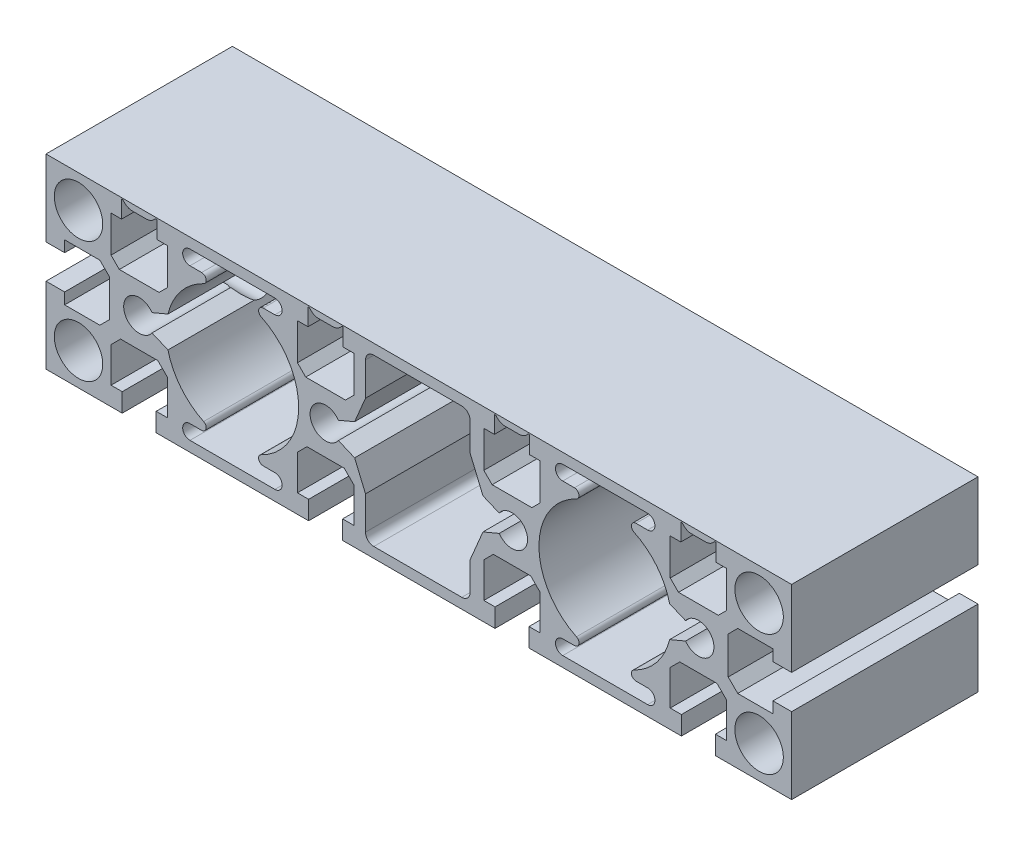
from build123d import *

# Parameters (mm, degrees)
SKETCH1_R                = 5.85
EXTRUDE1_DEPTH           = 45
F_8_2MM_DIA_HOLE_D       = 8.2
F_8_2MM_DIA_HOLE_DEPTH   = 38.1
F_8_2MM_DIA_HOLE_TIP     = 2.463528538
F_8_2MM_DIA_HOLE_2_D     = 8.2
F_8_2MM_DIA_HOLE_2_DEPTH = 38.1
F_8_2MM_DIA_HOLE_2_TIP   = 2.463528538


with BuildPart() as part:
    # Sketch1 → Extrude1 (new body)
    with BuildSketch(Plane.XY):
        Polygon((-90, 22.5), (-90, 4.1), (-85.5, 4.1), (-85.5, 6.8), (-77, 6.8), (-74.7, 4.5), (-74.7, -4.5), (-77, -6.8), (-85.5, -6.8), (-85.5, -4.1), (-90, -4.1), (-90, -22.5), (-71.6, -22.5), (-71.6, -18), (-74.3, -18), (-74.3, -9.5), (-72, -7.2), (-63, -7.2), (-60.7, -9.5), (-60.7, -18), (-63.4, -18), (-63.4, -22.5), (-26.6, -22.5), (-26.6, -18), (-29.3, -18), (-29.3, -9.5), (-27, -7.2), (-18, -7.2), (-15.7, -9.5), (-15.7, -18), (-18.4, -18), (-18.4, -22.5), (18.4, -22.5), (18.4, -18), (15.7, -18), (15.7, -9.5), (18, -7.2), (27, -7.2), (29.3, -9.5), (29.3, -18), (26.6, -18), (26.6, -22.5), (63.4, -22.5), (63.4, -18), (60.7, -18), (60.7, -9.5), (63, -7.2), (72, -7.2), (74.3, -9.5), (74.3, -18), (71.6, -18), (71.6, -22.5), (90, -22.5), (90, -4.1), (85.5, -4.1), (85.5, -6.8), (77, -6.8), (74.7, -4.5), (74.7, 4.5), (77, 6.8), (85.5, 6.8), (85.5, 4.1), (90, 4.1), (90, 22.5), align=None)
        with Locations(Location((82.15, 14.65, 0), (0, 0, 180))):
            Circle(SKETCH1_R, mode=Mode.SUBTRACT)
        with Locations(Location((82.15, -14.65, 0), (0, 0, 180))):
            Circle(SKETCH1_R, mode=Mode.SUBTRACT)
        with Locations(Location((-82.15, -14.65, 0), (0, 0, 180))):
            Circle(SKETCH1_R, mode=Mode.SUBTRACT)
        with Locations(Location((-82.15, 14.65, 0), (0, 0, 180))):
            Circle(SKETCH1_R, mode=Mode.SUBTRACT)
        with BuildLine():
            Line((-71.44998172, 22.200012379), (-70.982204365, 21.732234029))
            ThreePointArc((-70.982204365, 21.732234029), (-70.171145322, 21.190300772), (-69.214435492, 20.999999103))
            Line((-69.214435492, 20.999999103), (-65.785534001, 20.999999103))
            ThreePointArc((-65.785534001, 20.999999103), (-64.828786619, 21.190316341), (-64.017707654, 21.732291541))
            Line((-64.017707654, 21.732291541), (-63.550018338, 22.200012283))
            Line((-63.550018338, 22.200012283), (-63.250000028, 22.200012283))
            Line((-63.250000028, 22.200012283), (-63.250000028, 17.999999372))
            Line((-63.250000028, 17.999999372), (-60.699981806, 17.999999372))
            Line((-60.699981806, 17.999999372), (-60.699981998, 9.200011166))
            Line((-60.699981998, 9.200011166), (-62.699982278, 7.200011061))
            Line((-62.699982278, 7.200011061), (-72.299988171, 7.200011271))
            Line((-72.299988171, 7.200011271), (-74.299988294, 9.200011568))
            Line((-74.299988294, 9.200011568), (-74.299988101, 17.999999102))
            Line((-74.299988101, 17.999999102), (-71.750000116, 17.999999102))
            Line((-71.750000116, 17.999999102), (-71.750000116, 22.200012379))
            Line((-71.750000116, 22.200012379), (-71.44998172, 22.200012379))
        make_face(mode=Mode.SUBTRACT)
        with BuildLine():
            Line((-26.44998172, 22.200012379), (-25.982204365, 21.732234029))
            ThreePointArc((-25.982204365, 21.732234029), (-25.171145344, 21.190300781), (-24.21443554, 20.999999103))
            Line((-24.21443554, 20.999999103), (-20.785534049, 20.999999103))
            ThreePointArc((-20.785534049, 20.999999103), (-19.828786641, 21.190316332), (-19.017707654, 21.732291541))
            Line((-19.017707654, 21.732291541), (-18.550018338, 22.200012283))
            Line((-18.550018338, 22.200012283), (-18.250000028, 22.200012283))
            Line((-18.250000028, 22.200012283), (-18.250000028, 17.999999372))
            Line((-18.250000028, 17.999999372), (-15.699981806, 17.999999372))
            Line((-15.699981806, 17.999999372), (-15.699981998, 9.200011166))
            Line((-15.699981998, 9.200011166), (-17.699982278, 7.200011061))
            Line((-17.699982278, 7.200011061), (-27.299988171, 7.200011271))
            Line((-27.299988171, 7.200011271), (-29.299988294, 9.200011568))
            Line((-29.299988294, 9.200011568), (-29.299988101, 17.999999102))
            Line((-29.299988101, 17.999999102), (-26.750000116, 17.999999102))
            Line((-26.750000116, 17.999999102), (-26.750000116, 22.200012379))
            Line((-26.750000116, 22.200012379), (-26.44998172, 22.200012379))
        make_face(mode=Mode.SUBTRACT)
        with BuildLine():
            Line((18.550018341, 22.200012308), (19.017707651, 21.732291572))
            ThreePointArc((19.017707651, 21.732291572), (19.828786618, 21.190316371), (20.785534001, 20.999999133))
            Line((20.785534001, 20.999999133), (24.214435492, 20.999999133))
            ThreePointArc((24.214435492, 20.999999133), (25.171145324, 21.190300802), (25.982204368, 21.73223406))
            Line((25.982204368, 21.73223406), (26.449981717, 22.200012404))
            Line((26.449981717, 22.200012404), (26.750000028, 22.200012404))
            Line((26.750000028, 22.200012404), (26.750000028, 17.999999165))
            Line((26.750000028, 17.999999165), (29.299987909, 17.999999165))
            Line((29.299987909, 17.999999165), (29.299988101, 9.200011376))
            Line((29.299988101, 9.200011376), (27.299988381, 7.200011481))
            Line((27.299988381, 7.200011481), (17.699982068, 7.200011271))
            Line((17.699982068, 7.200011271), (15.69998219, 9.200010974))
            Line((15.69998219, 9.200010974), (15.699981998, 17.999999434))
            Line((15.699981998, 17.999999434), (18.250000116, 17.999999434))
            Line((18.250000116, 17.999999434), (18.250000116, 22.200012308))
            Line((18.250000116, 22.200012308), (18.550018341, 22.200012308))
        make_face(mode=Mode.SUBTRACT)
        with BuildLine():
            Line((63.550018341, 22.200012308), (64.017707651, 21.732291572))
            ThreePointArc((64.017707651, 21.732291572), (64.82878664, 21.190316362), (65.785534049, 20.999999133))
            Line((65.785534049, 20.999999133), (69.214435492, 20.999999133))
            ThreePointArc((69.214435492, 20.999999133), (70.171145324, 21.190300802), (70.982204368, 21.73223406))
            Line((70.982204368, 21.73223406), (71.449981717, 22.200012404))
            Line((71.449981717, 22.200012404), (71.750000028, 22.200012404))
            Line((71.750000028, 22.200012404), (71.750000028, 17.999999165))
            Line((71.750000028, 17.999999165), (74.299987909, 17.999999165))
            Line((74.299987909, 17.999999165), (74.299988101, 9.200011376))
            Line((74.299988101, 9.200011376), (72.299988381, 7.200011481))
            Line((72.299988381, 7.200011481), (62.699982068, 7.200011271))
            Line((62.699982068, 7.200011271), (60.69998219, 9.200010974))
            Line((60.69998219, 9.200010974), (60.699981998, 17.999999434))
            Line((60.699981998, 17.999999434), (63.250000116, 17.999999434))
            Line((63.250000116, 17.999999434), (63.250000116, 22.200012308))
            Line((63.250000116, 22.200012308), (63.550018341, 22.200012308))
        make_face(mode=Mode.SUBTRACT)
        with BuildLine():
            Line((34.75, -16.5), (37.577380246, -16.5))
            ThreePointArc((37.577380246, -16.5), (38.647446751, -15.646770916), (38.053891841, -14.413590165))
            ThreePointArc((38.053891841, -14.413590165), (29, 0), (38.053891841, 14.413590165))
            ThreePointArc((38.053891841, 14.413590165), (38.647446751, 15.646770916), (37.577380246, 16.5))
            Line((37.577380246, 16.5), (34.75, 16.5))
            ThreePointArc((34.75, 16.5), (33, 18.25), (34.75, 20))
            Line((34.75, 20), (55.25, 20))
            ThreePointArc((55.25, 20), (57, 18.25), (55.25, 16.5))
            Line((55.25, 16.5), (52.422619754, 16.5))
            ThreePointArc((52.422619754, 16.5), (51.352553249, 15.646770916), (51.946108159, 14.413590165))
            ThreePointArc((51.946108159, 14.413590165), (57.449722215, 10.050095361), (60.55434023, 3.75))
            Line((60.55434023, 3.75), (64.410198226, 2.125))
            ThreePointArc((64.410198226, 2.125), (71.25, 0), (64.410198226, -2.125))
            Line((64.410198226, -2.125), (60.55434023, -3.75))
            ThreePointArc((60.55434023, -3.75), (57.449722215, -10.050095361), (51.946108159, -14.413590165))
            ThreePointArc((51.946108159, -14.413590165), (51.352553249, -15.646770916), (52.422619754, -16.5))
            Line((52.422619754, -16.5), (55.25, -16.5))
            ThreePointArc((55.25, -16.5), (57, -18.25), (55.25, -20))
            Line((55.25, -20), (34.75, -20))
            ThreePointArc((34.75, -20), (33, -18.25), (34.75, -16.5))
        make_face(mode=Mode.SUBTRACT)
        with BuildLine():
            Line((-15.489370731, -3.77738053), (-19.410198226, -2.125))
            ThreePointArc((-19.410198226, -2.125), (-26.25, 0), (-19.410198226, 2.125))
            Line((-19.410198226, 2.125), (-15.489370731, 3.77738053))
            Line((-15.489370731, 3.77738053), (-12.866930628, 10))
            Line((-12.866930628, 10), (-12.866930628, 18))
            ThreePointArc((-12.866930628, 18), (-12.281144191, 19.414213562), (-10.866930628, 20))
            Line((-10.866930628, 20), (10.383069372, 20))
            ThreePointArc((10.383069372, 20), (11.797282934, 19.414213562), (12.383069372, 18))
            Line((12.383069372, 18), (12.383069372, 11.148123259))
            Line((12.383069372, 11.148123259), (15.489370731, 3.77738053))
            Line((15.489370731, 3.77738053), (19.410198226, 2.125))
            ThreePointArc((19.410198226, 2.125), (26.25, 0), (19.410198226, -2.125))
            Line((19.410198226, -2.125), (15.489370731, -3.77738053))
            Line((15.489370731, -3.77738053), (12.383069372, -11.148123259))
            Line((12.383069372, -11.148123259), (12.383069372, -18))
            ThreePointArc((12.383069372, -18), (11.797282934, -19.414213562), (10.383069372, -20))
            Line((10.383069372, -20), (-10.866930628, -20))
            ThreePointArc((-10.866930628, -20), (-12.281144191, -19.414213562), (-12.866930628, -18))
            Line((-12.866930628, -18), (-12.866930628, -10))
            Line((-12.866930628, -10), (-15.489370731, -3.77738053))
        make_face(mode=Mode.SUBTRACT)
        with BuildLine():
            Line((-52.422619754, 16.5), (-55.25, 16.5))
            ThreePointArc((-55.25, 16.5), (-57, 18.25), (-55.25, 20))
            Line((-55.25, 20), (-34.75, 20))
            ThreePointArc((-34.75, 20), (-33, 18.25), (-34.75, 16.5))
            Line((-34.75, 16.5), (-37.577380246, 16.5))
            ThreePointArc((-37.577380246, 16.5), (-38.647446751, 15.646770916), (-38.053891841, 14.413590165))
            ThreePointArc((-38.053891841, 14.413590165), (-29, 0), (-38.053891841, -14.413590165))
            ThreePointArc((-38.053891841, -14.413590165), (-38.647446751, -15.646770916), (-37.577380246, -16.5))
            Line((-37.577380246, -16.5), (-34.75, -16.5))
            ThreePointArc((-34.75, -16.5), (-33, -18.25), (-34.75, -20))
            Line((-34.75, -20), (-55.25, -20))
            ThreePointArc((-55.25, -20), (-57, -18.25), (-55.25, -16.5))
            Line((-55.25, -16.5), (-52.422619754, -16.5))
            ThreePointArc((-52.422619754, -16.5), (-51.352553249, -15.646770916), (-51.946108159, -14.413590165))
            ThreePointArc((-51.946108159, -14.413590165), (-57.449722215, -10.050095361), (-60.55434023, -3.75))
            Line((-60.55434023, -3.75), (-64.410198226, -2.125))
            ThreePointArc((-64.410198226, -2.125), (-71.25, 0), (-64.410198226, 2.125))
            Line((-64.410198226, 2.125), (-60.55434023, 3.75))
            ThreePointArc((-60.55434023, 3.75), (-57.449722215, 10.050095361), (-51.946108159, 14.413590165))
            ThreePointArc((-51.946108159, 14.413590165), (-51.352553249, 15.646770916), (-52.422619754, 16.5))
        make_face(mode=Mode.SUBTRACT)
    extrude(amount=EXTRUDE1_DEPTH)

    # 8.2mm DIA HOLE
    with Locations(Plane(origin=(90, 0, 22.5), x_dir=(0, 0, 1), z_dir=(1, 0, 0))):
        with Locations((0, 0)):
            Hole(F_8_2MM_DIA_HOLE_D / 2, depth=F_8_2MM_DIA_HOLE_DEPTH)
            with Locations((0, 0, -(F_8_2MM_DIA_HOLE_DEPTH + F_8_2MM_DIA_HOLE_TIP / 2))):  # 118° drill point
                Cone(0, F_8_2MM_DIA_HOLE_D / 2, F_8_2MM_DIA_HOLE_TIP, mode=Mode.SUBTRACT)

    # 8.2mm DIA HOLE 2
    with Locations(Plane(origin=(-90, 0, 22.5), x_dir=(0, -1, 0), z_dir=(-1, 0, 0))):
        with Locations((0, 0)):
            Hole(F_8_2MM_DIA_HOLE_2_D / 2, depth=F_8_2MM_DIA_HOLE_2_DEPTH)
            with Locations((0, 0, -(F_8_2MM_DIA_HOLE_2_DEPTH + F_8_2MM_DIA_HOLE_2_TIP / 2))):  # 118° drill point
                Cone(0, F_8_2MM_DIA_HOLE_2_D / 2, F_8_2MM_DIA_HOLE_2_TIP, mode=Mode.SUBTRACT)


solid = part.part
